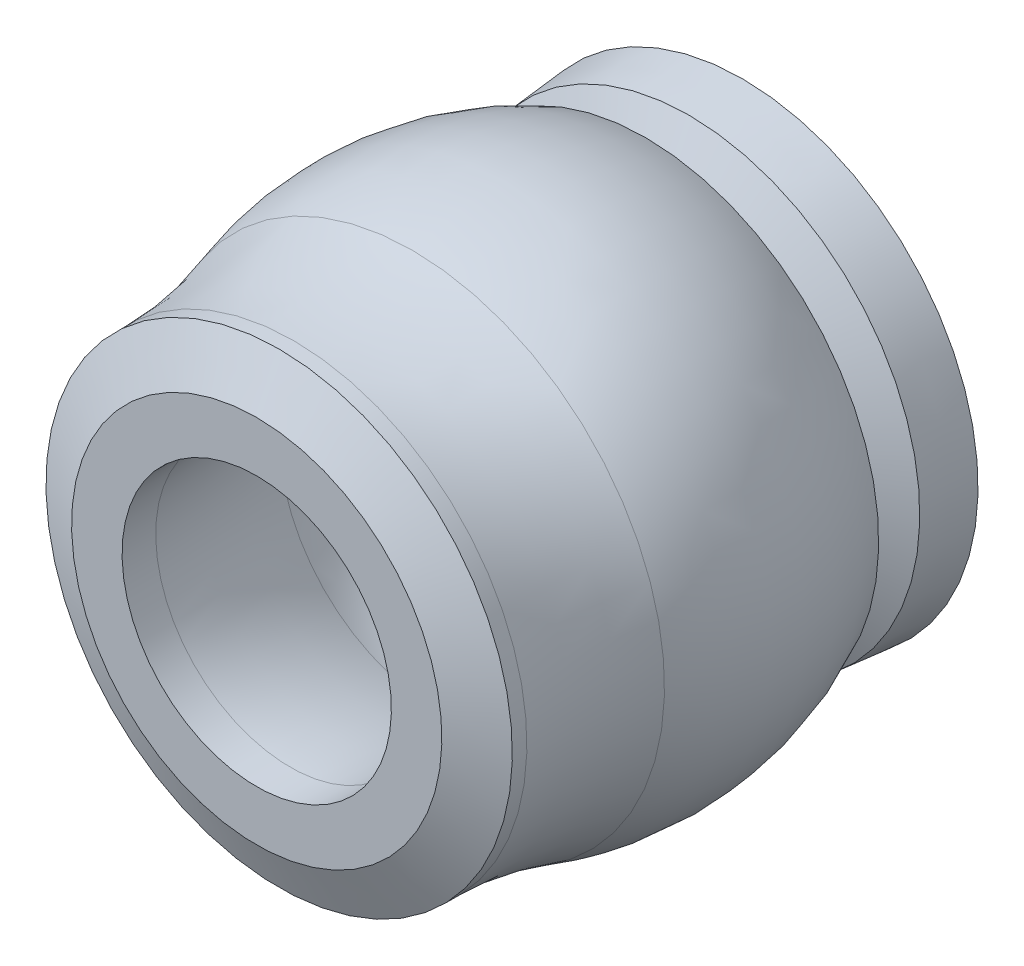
ISO-10303-21;
HEADER;
FILE_DESCRIPTION(('STEP AP214'),'2;1');
FILE_NAME('part.step','',(''),(''),'','','');
FILE_SCHEMA(('AUTOMOTIVE_DESIGN { 1 0 10303 214 1 1 1 1 }'));
ENDSEC;
DATA;
#1=APPLICATION_CONTEXT('core data for automotive mechanical design processes');
#2=APPLICATION_PROTOCOL_DEFINITION('international standard','automotive_design',2000,#1);
#3=PRODUCT_CONTEXT('',#1,'mechanical');
#4=PRODUCT('Part','Part','',(#3));
#5=PRODUCT_RELATED_PRODUCT_CATEGORY('part','',(#4));
#6=PRODUCT_DEFINITION_FORMATION('','',#4);
#7=PRODUCT_DEFINITION_CONTEXT('part definition',#1,'design');
#8=PRODUCT_DEFINITION('design','',#6,#7);
#9=PRODUCT_DEFINITION_SHAPE('','',#8);
#10=(LENGTH_UNIT() NAMED_UNIT(*) SI_UNIT(.MILLI.,.METRE.));
#11=(NAMED_UNIT(*) PLANE_ANGLE_UNIT() SI_UNIT($,.RADIAN.));
#12=(NAMED_UNIT(*) SI_UNIT($,.STERADIAN.) SOLID_ANGLE_UNIT());
#13=UNCERTAINTY_MEASURE_WITH_UNIT(LENGTH_MEASURE(1.E-05),#10,'distance_accuracy_value','');
#14=(GEOMETRIC_REPRESENTATION_CONTEXT(3) GLOBAL_UNCERTAINTY_ASSIGNED_CONTEXT((#13)) GLOBAL_UNIT_ASSIGNED_CONTEXT((#10,
#11,#12)) REPRESENTATION_CONTEXT('',''));
#15=CARTESIAN_POINT('',(0.,0.,0.));
#16=DIRECTION('',(0.,0.,1.));
#17=DIRECTION('',(1.,0.,0.));
#18=AXIS2_PLACEMENT_3D('',#15,#16,#17);
#19=CARTESIAN_POINT('',(0.,0.,5.68272830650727));
#20=DIRECTION('',(0.,0.,-1.));
#21=DIRECTION('',(0.,1.,0.));
#22=AXIS2_PLACEMENT_3D('',#19,#20,#21);
#23=TOROIDAL_SURFACE('',#22,8.636,1.524);
#24=CARTESIAN_POINT('',(0.,0.,5.68272830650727));
#25=DIRECTION('',(0.,0.,-1.));
#26=DIRECTION('',(0.,1.,0.));
#27=AXIS2_PLACEMENT_3D('',#24,#25,#26);
#28=CIRCLE('',#27,7.112);
#29=CARTESIAN_POINT('',(0.,7.112,5.68272830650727));
#30=VERTEX_POINT('',#29);
#31=EDGE_CURVE('E95',#30,#30,#28,.T.);
#32=ORIENTED_EDGE('',*,*,#31,.T.);
#33=EDGE_LOOP('',(#32));
#34=FACE_BOUND('',#33,.T.);
#35=CARTESIAN_POINT('',(0.,0.,6.43222015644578));
#36=DIRECTION('',(0.,0.,-1.));
#37=DIRECTION('',(0.,1.,0.));
#38=AXIS2_PLACEMENT_3D('',#35,#36,#37);
#39=CIRCLE('',#38,7.30903430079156);
#40=CARTESIAN_POINT('',(0.,7.30903430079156,6.43222015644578));
#41=VERTEX_POINT('',#40);
#42=EDGE_CURVE('E98',#41,#41,#39,.F.);
#43=ORIENTED_EDGE('',*,*,#42,.T.);
#44=EDGE_LOOP('',(#43));
#45=FACE_BOUND('',#44,.T.);
#46=ADVANCED_FACE('F12',(#34,#45),#23,.T.);
#47=CARTESIAN_POINT('',(0.,-3.33828571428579,12.446));
#48=DIRECTION('',(1.,0.,0.));
#49=DIRECTION('',(0.,1.,0.));
#50=AXIS2_PLACEMENT_3D('',#47,#48,#49);
#51=CIRCLE('',#50,12.2282857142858);
#52=TRIMMED_CURVE('',#51,(PARAMETER_VALUE(-1.29428929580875)),
(PARAMETER_VALUE(1.29428929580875)),.T.,.PARAMETER.);
#53=CARTESIAN_POINT('',(0.,0.,12.446));
#54=DIRECTION('',(0.,0.,-1.));
#55=AXIS1_PLACEMENT('',#53,#54);
#56=SURFACE_OF_REVOLUTION('',#52,#55);
#57=ORIENTED_EDGE('',*,*,#42,.F.);
#58=EDGE_LOOP('',(#57));
#59=FACE_BOUND('',#58,.T.);
#60=CARTESIAN_POINT('',(0.,0.,16.1604744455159));
#61=DIRECTION('',(0.,0.,-1.));
#62=DIRECTION('',(0.,1.,0.));
#63=AXIS2_PLACEMENT_3D('',#60,#61,#62);
#64=CIRCLE('',#63,8.31219286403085);
#65=CARTESIAN_POINT('',(0.,8.31219286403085,16.1604744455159));
#66=VERTEX_POINT('',#65);
#67=EDGE_CURVE('E94',#66,#66,#64,.T.);
#68=ORIENTED_EDGE('',*,*,#67,.F.);
#69=EDGE_LOOP('',(#68));
#70=FACE_BOUND('',#69,.T.);
#71=ADVANCED_FACE('F106',(#59,#70),#56,.T.);
#72=CARTESIAN_POINT('',(0.,0.,-8.75417374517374));
#73=DIRECTION('',(0.,0.,-1.));
#74=DIRECTION('',(0.,1.,0.));
#75=AXIS2_PLACEMENT_3D('',#72,#73,#74);
#76=CYLINDRICAL_SURFACE('',#75,7.112);
#77=CARTESIAN_POINT('',(0.,0.,5.67152681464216));
#78=DIRECTION('',(0.,0.,1.));
#79=DIRECTION('',(0.,-1.,0.));
#80=AXIS2_PLACEMENT_3D('',#77,#78,#79);
#81=CIRCLE('',#80,7.112);
#82=CARTESIAN_POINT('',(0.,-7.112,5.67152681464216));
#83=VERTEX_POINT('',#82);
#84=EDGE_CURVE('E91',#83,#83,#81,.F.);
#85=ORIENTED_EDGE('',*,*,#84,.T.);
#86=EDGE_LOOP('',(#85));
#87=FACE_BOUND('',#86,.T.);
#88=ORIENTED_EDGE('',*,*,#31,.F.);
#89=EDGE_LOOP('',(#88));
#90=FACE_BOUND('',#89,.T.);
#91=ADVANCED_FACE('F84',(#87,#90),#76,.F.);
#92=CARTESIAN_POINT('',(0.,0.,23.876));
#93=DIRECTION('',(0.,0.,-1.));
#94=DIRECTION('',(0.,1.,0.));
#95=AXIS2_PLACEMENT_3D('',#92,#93,#94);
#96=TOROIDAL_SURFACE('',#95,32.512,25.4);
#97=ORIENTED_EDGE('',*,*,#67,.T.);
#98=EDGE_LOOP('',(#97));
#99=FACE_BOUND('',#98,.T.);
#100=CARTESIAN_POINT('',(0.,0.,23.876));
#101=DIRECTION('',(0.,0.,-1.));
#102=DIRECTION('',(0.,1.,0.));
#103=AXIS2_PLACEMENT_3D('',#100,#101,#102);
#104=CIRCLE('',#103,7.112);
#105=CARTESIAN_POINT('',(0.,7.112,23.876));
#106=VERTEX_POINT('',#105);
#107=EDGE_CURVE('E89',#106,#106,#104,.F.);
#108=ORIENTED_EDGE('',*,*,#107,.T.);
#109=EDGE_LOOP('',(#108));
#110=FACE_BOUND('',#109,.T.);
#111=ADVANCED_FACE('F79',(#99,#110),#96,.T.);
#112=CARTESIAN_POINT('',(0.,0.,5.67152681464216));
#113=DIRECTION('',(0.,0.,1.));
#114=DIRECTION('',(-1.,0.,0.));
#115=AXIS2_PLACEMENT_3D('',#112,#113,#114);
#116=CONICAL_SURFACE('',#115,7.112,1.13446401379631);
#117=ORIENTED_EDGE('',*,*,#84,.F.);
#118=EDGE_LOOP('',(#117));
#119=FACE_BOUND('',#118,.T.);
#120=CARTESIAN_POINT('',(0.,0.,4.191));
#121=DIRECTION('',(0.,0.,-1.));
#122=DIRECTION('',(0.,1.,0.));
#123=AXIS2_PLACEMENT_3D('',#120,#121,#122);
#124=CIRCLE('',#123,3.937);
#125=CARTESIAN_POINT('',(0.,3.937,4.191));
#126=VERTEX_POINT('',#125);
#127=EDGE_CURVE('E143',#126,#126,#124,.T.);
#128=ORIENTED_EDGE('',*,*,#127,.T.);
#129=EDGE_LOOP('',(#128));
#130=FACE_BOUND('',#129,.T.);
#131=ADVANCED_FACE('F75',(#119,#130),#116,.F.);
#132=CARTESIAN_POINT('',(0.,0.,-8.75417374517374));
#133=DIRECTION('',(0.,0.,-1.));
#134=DIRECTION('',(0.,1.,0.));
#135=AXIS2_PLACEMENT_3D('',#132,#133,#134);
#136=CYLINDRICAL_SURFACE('',#135,7.112);
#137=ORIENTED_EDGE('',*,*,#107,.F.);
#138=EDGE_LOOP('',(#137));
#139=FACE_BOUND('',#138,.T.);
#140=CARTESIAN_POINT('',(0.,0.,25.654));
#141=DIRECTION('',(0.,0.,-1.));
#142=DIRECTION('',(0.,1.,0.));
#143=AXIS2_PLACEMENT_3D('',#140,#141,#142);
#144=CIRCLE('',#143,7.112);
#145=CARTESIAN_POINT('',(0.,7.112,25.654));
#146=VERTEX_POINT('',#145);
#147=EDGE_CURVE('E16',#146,#146,#144,.T.);
#148=ORIENTED_EDGE('',*,*,#147,.F.);
#149=EDGE_LOOP('',(#148));
#150=FACE_BOUND('',#149,.T.);
#151=ADVANCED_FACE('F71',(#139,#150),#136,.F.);
#152=CARTESIAN_POINT('',(0.,0.,-8.75417374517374));
#153=DIRECTION('',(0.,0.,-1.));
#154=DIRECTION('',(0.,1.,0.));
#155=AXIS2_PLACEMENT_3D('',#152,#153,#154);
#156=CYLINDRICAL_SURFACE('',#155,3.937);
#157=CARTESIAN_POINT('',(0.,0.,0.));
#158=DIRECTION('',(0.,0.,-1.));
#159=DIRECTION('',(0.,1.,0.));
#160=AXIS2_PLACEMENT_3D('',#157,#158,#159);
#161=CIRCLE('',#160,3.937);
#162=CARTESIAN_POINT('',(0.,3.937,0.));
#163=VERTEX_POINT('',#162);
#164=EDGE_CURVE('E148',#163,#163,#161,.F.);
#165=ORIENTED_EDGE('',*,*,#164,.F.);
#166=EDGE_LOOP('',(#165));
#167=FACE_BOUND('',#166,.T.);
#168=ORIENTED_EDGE('',*,*,#127,.F.);
#169=EDGE_LOOP('',(#168));
#170=FACE_BOUND('',#169,.T.);
#171=ADVANCED_FACE('F67',(#167,#170),#156,.F.);
#172=CARTESIAN_POINT('',(9.779,0.,25.654));
#173=DIRECTION('',(0.,0.,1.));
#174=DIRECTION('',(0.,-1.,0.));
#175=AXIS2_PLACEMENT_3D('',#172,#173,#174);
#176=PLANE('',#175);
#177=CARTESIAN_POINT('',(0.,0.,25.654));
#178=DIRECTION('',(0.,0.,-1.));
#179=DIRECTION('',(0.,1.,0.));
#180=AXIS2_PLACEMENT_3D('',#177,#178,#179);
#181=CIRCLE('',#180,9.779);
#182=CARTESIAN_POINT('',(0.,9.779,25.654));
#183=VERTEX_POINT('',#182);
#184=EDGE_CURVE('E156',#183,#183,#181,.T.);
#185=ORIENTED_EDGE('',*,*,#184,.F.);
#186=EDGE_LOOP('',(#185));
#187=FACE_BOUND('',#186,.T.);
#188=ORIENTED_EDGE('',*,*,#147,.T.);
#189=EDGE_LOOP('',(#188));
#190=FACE_BOUND('',#189,.T.);
#191=ADVANCED_FACE('F63',(#187,#190),#176,.T.);
#192=CARTESIAN_POINT('',(3.937,0.,0.));
#193=DIRECTION('',(0.,0.,-1.));
#194=DIRECTION('',(0.,1.,0.));
#195=AXIS2_PLACEMENT_3D('',#192,#193,#194);
#196=PLANE('',#195);
#197=ORIENTED_EDGE('',*,*,#164,.T.);
#198=EDGE_LOOP('',(#197));
#199=FACE_BOUND('',#198,.T.);
#200=CARTESIAN_POINT('',(0.,0.,0.));
#201=DIRECTION('',(0.,0.,-1.));
#202=DIRECTION('',(0.,1.,0.));
#203=AXIS2_PLACEMENT_3D('',#200,#201,#202);
#204=CIRCLE('',#203,12.446);
#205=CARTESIAN_POINT('',(0.,12.446,0.));
#206=VERTEX_POINT('',#205);
#207=EDGE_CURVE('E141',#206,#206,#204,.F.);
#208=ORIENTED_EDGE('',*,*,#207,.F.);
#209=EDGE_LOOP('',(#208));
#210=FACE_BOUND('',#209,.T.);
#211=ADVANCED_FACE('F59',(#199,#210),#196,.T.);
#212=CARTESIAN_POINT('',(0.,0.,24.4695785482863));
#213=DIRECTION('',(0.,0.,-1.));
#214=DIRECTION('',(0.,1.,0.));
#215=AXIS2_PLACEMENT_3D('',#212,#213,#214);
#216=CONICAL_SURFACE('',#215,12.319,1.13446401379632);
#217=ORIENTED_EDGE('',*,*,#184,.T.);
#218=EDGE_LOOP('',(#217));
#219=FACE_BOUND('',#218,.T.);
#220=CARTESIAN_POINT('',(0.,0.,24.4695785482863));
#221=DIRECTION('',(0.,0.,-1.));
#222=DIRECTION('',(0.,1.,0.));
#223=AXIS2_PLACEMENT_3D('',#220,#221,#222);
#224=CIRCLE('',#223,12.319);
#225=CARTESIAN_POINT('',(0.,12.319,24.4695785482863));
#226=VERTEX_POINT('',#225);
#227=EDGE_CURVE('E138',#226,#226,#224,.T.);
#228=ORIENTED_EDGE('',*,*,#227,.F.);
#229=EDGE_LOOP('',(#228));
#230=FACE_BOUND('',#229,.T.);
#231=ADVANCED_FACE('F55',(#219,#230),#216,.T.);
#232=CARTESIAN_POINT('',(0.,0.,0.));
#233=DIRECTION('',(0.,0.,-1.));
#234=DIRECTION('',(0.,1.,0.));
#235=AXIS2_PLACEMENT_3D('',#232,#233,#234);
#236=CONICAL_SURFACE('',#235,12.446,0.0927067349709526);
#237=CARTESIAN_POINT('',(0.,0.,2.8154174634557));
#238=DIRECTION('',(0.,0.,-1.));
#239=DIRECTION('',(0.,1.,0.));
#240=AXIS2_PLACEMENT_3D('',#237,#238,#239);
#241=CIRCLE('',#240,12.1842415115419);
#242=CARTESIAN_POINT('',(0.,12.1842415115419,2.8154174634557));
#243=VERTEX_POINT('',#242);
#244=EDGE_CURVE('E137',#243,#243,#241,.F.);
#245=ORIENTED_EDGE('',*,*,#244,.F.);
#246=EDGE_LOOP('',(#245));
#247=FACE_BOUND('',#246,.T.);
#248=ORIENTED_EDGE('',*,*,#207,.T.);
#249=EDGE_LOOP('',(#248));
#250=FACE_BOUND('',#249,.T.);
#251=ADVANCED_FACE('F51',(#247,#250),#236,.T.);
#252=CARTESIAN_POINT('',(0.,0.,-8.75417374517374));
#253=DIRECTION('',(0.,0.,-1.));
#254=DIRECTION('',(0.,1.,0.));
#255=AXIS2_PLACEMENT_3D('',#252,#253,#254);
#256=CYLINDRICAL_SURFACE('',#255,12.319);
#257=ORIENTED_EDGE('',*,*,#227,.T.);
#258=EDGE_LOOP('',(#257));
#259=FACE_BOUND('',#258,.T.);
#260=CARTESIAN_POINT('',(0.,0.,23.7010862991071));
#261=DIRECTION('',(0.,0.,-1.));
#262=DIRECTION('',(0.,1.,0.));
#263=AXIS2_PLACEMENT_3D('',#260,#261,#262);
#264=CIRCLE('',#263,12.319);
#265=CARTESIAN_POINT('',(0.,12.319,23.7010862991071));
#266=VERTEX_POINT('',#265);
#267=EDGE_CURVE('E32',#266,#266,#264,.F.);
#268=ORIENTED_EDGE('',*,*,#267,.T.);
#269=EDGE_LOOP('',(#268));
#270=FACE_BOUND('',#269,.T.);
#271=ADVANCED_FACE('F47',(#259,#270),#256,.T.);
#272=CARTESIAN_POINT('',(0.,0.,2.8154174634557));
#273=DIRECTION('',(0.,0.,-1.));
#274=DIRECTION('',(0.,1.,0.));
#275=AXIS2_PLACEMENT_3D('',#272,#273,#274);
#276=CONICAL_SURFACE('',#275,12.1842415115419,1.13446401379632);
#277=CARTESIAN_POINT('',(0.,0.,3.937));
#278=DIRECTION('',(0.,0.,1.));
#279=DIRECTION('',(0.,-1.,0.));
#280=AXIS2_PLACEMENT_3D('',#277,#278,#279);
#281=CIRCLE('',#280,9.779);
#282=CARTESIAN_POINT('',(0.,-9.779,3.937));
#283=VERTEX_POINT('',#282);
#284=EDGE_CURVE('E25',#283,#283,#281,.T.);
#285=ORIENTED_EDGE('',*,*,#284,.F.);
#286=EDGE_LOOP('',(#285));
#287=FACE_BOUND('',#286,.T.);
#288=ORIENTED_EDGE('',*,*,#244,.T.);
#289=EDGE_LOOP('',(#288));
#290=FACE_BOUND('',#289,.T.);
#291=ADVANCED_FACE('F42',(#287,#290),#276,.T.);
#292=CARTESIAN_POINT('',(0.,0.,23.7010862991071));
#293=DIRECTION('',(0.,0.,-1.));
#294=DIRECTION('',(0.,1.,0.));
#295=AXIS2_PLACEMENT_3D('',#292,#293,#294);
#296=TOROIDAL_SURFACE('',#295,32.639,20.32);
#297=ORIENTED_EDGE('',*,*,#267,.F.);
#298=EDGE_LOOP('',(#297));
#299=FACE_BOUND('',#298,.T.);
#300=CARTESIAN_POINT('',(0.,0.,17.4263930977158));
#301=DIRECTION('',(0.,0.,-1.));
#302=DIRECTION('',(0.,1.,0.));
#303=AXIS2_PLACEMENT_3D('',#300,#301,#302);
#304=CIRCLE('',#303,13.3120595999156);
#305=CARTESIAN_POINT('',(0.,13.3120595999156,17.4263930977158));
#306=VERTEX_POINT('',#305);
#307=EDGE_CURVE('E20',#306,#306,#304,.T.);
#308=ORIENTED_EDGE('',*,*,#307,.F.);
#309=EDGE_LOOP('',(#308));
#310=FACE_BOUND('',#309,.T.);
#311=ADVANCED_FACE('F37',(#299,#310),#296,.F.);
#312=CARTESIAN_POINT('',(0.,0.,5.1214214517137));
#313=DIRECTION('',(0.,0.,1.));
#314=DIRECTION('',(-1.,0.,0.));
#315=AXIS2_PLACEMENT_3D('',#312,#313,#314);
#316=CONICAL_SURFACE('',#315,12.319,1.13446401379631);
#317=ORIENTED_EDGE('',*,*,#284,.T.);
#318=EDGE_LOOP('',(#317));
#319=FACE_BOUND('',#318,.T.);
#320=CARTESIAN_POINT('',(0.,0.,5.12142145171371));
#321=DIRECTION('',(0.,0.,-1.));
#322=DIRECTION('',(0.,1.,0.));
#323=AXIS2_PLACEMENT_3D('',#320,#321,#322);
#324=CIRCLE('',#323,12.319);
#325=CARTESIAN_POINT('',(0.,12.319,5.12142145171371));
#326=VERTEX_POINT('',#325);
#327=EDGE_CURVE('E8',#326,#326,#324,.F.);
#328=ORIENTED_EDGE('',*,*,#327,.F.);
#329=EDGE_LOOP('',(#328));
#330=FACE_BOUND('',#329,.T.);
#331=ADVANCED_FACE('F41',(#319,#330),#316,.T.);
#332=CARTESIAN_POINT('',(0.,-1.96446190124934,12.4667107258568));
#333=DIRECTION('',(1.,0.,0.));
#334=DIRECTION('',(0.,1.,0.));
#335=AXIS2_PLACEMENT_3D('',#332,#333,#334);
#336=CIRCLE('',#335,16.0614619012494);
#337=TRIMMED_CURVE('',#336,(PARAMETER_VALUE(-1.44818027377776)),
(PARAMETER_VALUE(1.44818027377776)),.T.,.PARAMETER.);
#338=CARTESIAN_POINT('',(0.,0.,12.4667107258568));
#339=DIRECTION('',(0.,0.,-1.));
#340=AXIS1_PLACEMENT('',#338,#339);
#341=SURFACE_OF_REVOLUTION('',#337,#340);
#342=ORIENTED_EDGE('',*,*,#307,.T.);
#343=EDGE_LOOP('',(#342));
#344=FACE_BOUND('',#343,.T.);
#345=ORIENTED_EDGE('',*,*,#327,.T.);
#346=EDGE_LOOP('',(#345));
#347=FACE_BOUND('',#346,.T.);
#348=ADVANCED_FACE('F119',(#344,#347),#341,.F.);
#349=CLOSED_SHELL('',(#46,#71,#91,#111,#131,#151,#171,#191,#211,#231,#251,#271,#291,#311,#331,#348));
#350=MANIFOLD_SOLID_BREP('B1',#349);
#351=ADVANCED_BREP_SHAPE_REPRESENTATION('',(#18,#350),#14);
#352=SHAPE_DEFINITION_REPRESENTATION(#9,#351);
ENDSEC;
END-ISO-10303-21;
